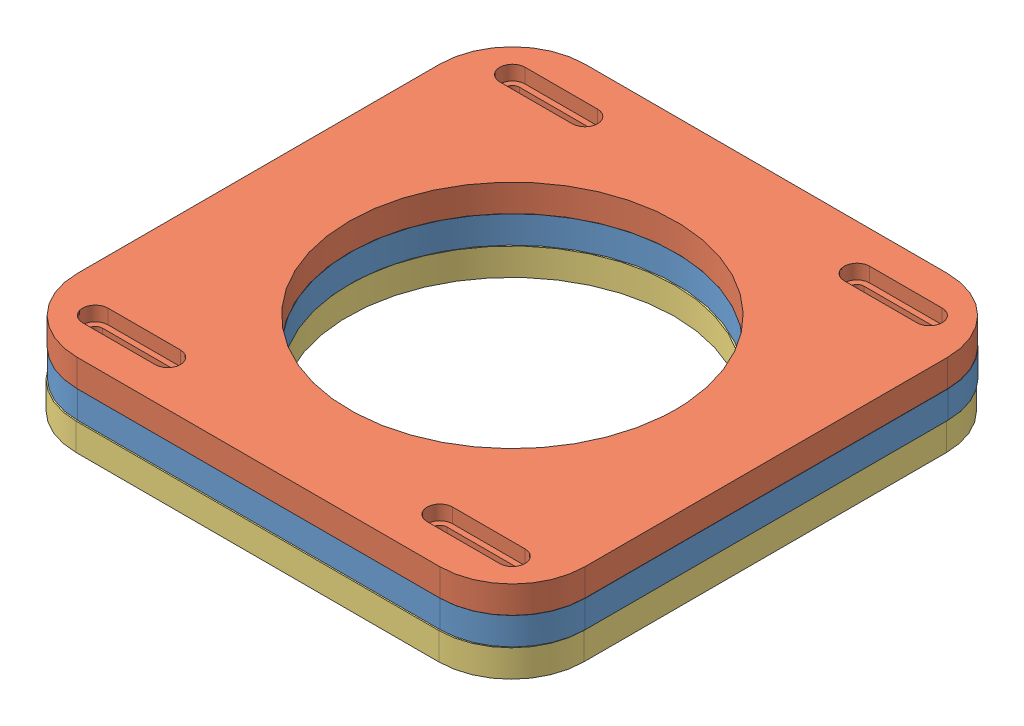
SolidWorks assembly pinnedAssem.SLDASM, configuration Default (file format 13000). Lengths in mm.
Overall size (239.13 28.58 223.36).
3 component instances, 3 part files, 9 mates.
Components (placement in the parent):
- centerPlate-1: centerPlate.SLDPRT [Default] at (82.1658 86.9883 138.5452) size (177.8 9.53 177.8)
- topPlate-1: topPlate.SLDPRT [Default] at (82.0559 106.0383 138.5452) x (0 0 1) z (1 0 0) size (177.8 9.53 177.8)
- bottomPlate-1: bottomPlate.SLDPRT [Default] at (82.1658 77.4633 139.0309) size (239.13 9.53 223.36)
Mates (geometry in assembly coordinates):
- Slot1: slot: cylinder of centerPlate-1 through (44.0658 90.1633 202.0452) axis (0 1 0) radius 3.175; plane of topPlate-1 through (31.2559 102.8633 198.8702) normal (0 0 1); cylinder of topPlate-1 through (132.8559 102.8633 202.0452) axis (0 -1 0) radius 3.175
- Parallel1: parallel aligned: plane of centerPlate-1 through (171.0658 96.5133 49.6452) normal (1 0 0); plane of topPlate-1 through (170.9559 96.5133 49.6452) normal (1 0 0)
- Coincident2: coincident anti-aligned: plane of centerPlate-1 through (82.1658 96.5133 138.5452) normal (0 1 0); plane of topPlate-1 through (82.0559 96.5133 138.5452) normal (0 -1 0)
- Slot5: slot: cylinder of centerPlate-1 through (142.4908 86.9883 211.5702) axis (0 1 0) radius 2.5527; plane of topPlate-1 through (155.0809 106.0383 209.081) normal (0 0 1); cylinder of topPlate-1 through (129.6809 106.0383 211.5702) axis (0 -1 0) radius 2.4892
- Coincident3: coincident anti-aligned: plane of centerPlate-1 through (82.1658 86.9883 138.5452) normal (0 -1 0); plane of bottomPlate-1 through (82.1658 86.9883 139.0309) normal (0 1 0)
- Parallel2: parallel aligned: plane of centerPlate-1 through (171.0658 96.5133 49.6452) normal (1 0 0); plane of bottomPlate-1 through (171.0658 86.9883 50.1309) normal (1 0 0)
- Slot9: slot: cylinder of centerPlate-1 through (155.1908 96.5133 198.8702) axis (0 -1 0) radius 2.5527; plane of bottomPlate-1 through (152.7016 77.4633 212.0559) normal (1 0 0); cylinder of bottomPlate-1 through (155.1908 77.4633 186.6559) axis (0 1 0) radius 2.4892
- Slot10: slot: plane of bottomPlate-1 through (152.7016 77.4633 66.0059) normal (1 0 0); cylinder of centerPlate-1 through (155.1908 96.5133 78.2202) axis (0 -1 0) radius 2.5527; cylinder of bottomPlate-1 through (155.1908 77.4633 91.4059) axis (0 1 0) radius 2.4892
- Slot11: slot: plane of bottomPlate-1 through (6.6516 77.4633 212.0559) normal (1 0 0); cylinder of centerPlate-1 through (9.1408 96.5133 198.8702) axis (0 -1 0) radius 2.5527; cylinder of bottomPlate-1 through (9.1408 77.4633 212.0559) axis (0 1 0) radius 2.4892
